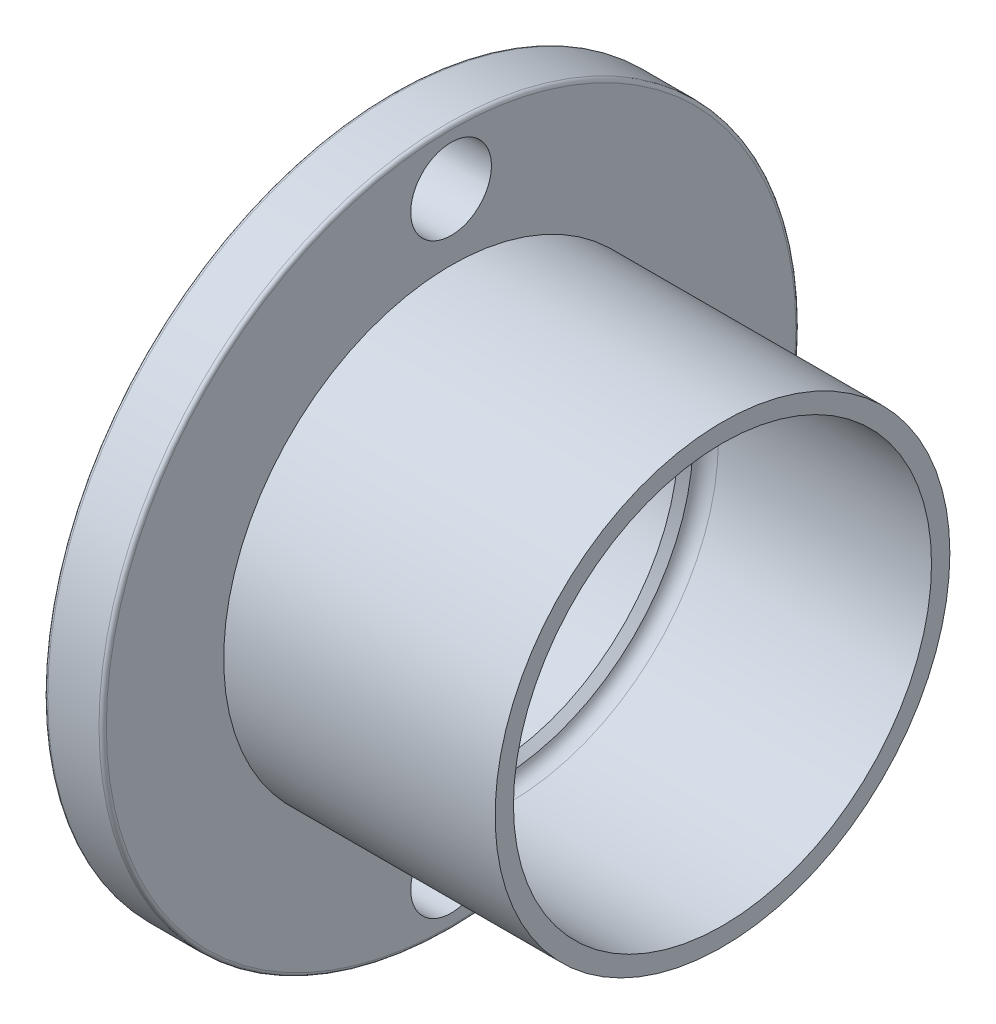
ISO-10303-21;
HEADER;
FILE_DESCRIPTION(('STEP AP214'),'2;1');
FILE_NAME('part.step','',(''),(''),'','','');
FILE_SCHEMA(('AUTOMOTIVE_DESIGN { 1 0 10303 214 1 1 1 1 }'));
ENDSEC;
DATA;
#1=APPLICATION_CONTEXT('core data for automotive mechanical design processes');
#2=APPLICATION_PROTOCOL_DEFINITION('international standard','automotive_design',2000,#1);
#3=PRODUCT_CONTEXT('',#1,'mechanical');
#4=PRODUCT('Part','Part','',(#3));
#5=PRODUCT_RELATED_PRODUCT_CATEGORY('part','',(#4));
#6=PRODUCT_DEFINITION_FORMATION('','',#4);
#7=PRODUCT_DEFINITION_CONTEXT('part definition',#1,'design');
#8=PRODUCT_DEFINITION('design','',#6,#7);
#9=PRODUCT_DEFINITION_SHAPE('','',#8);
#10=(LENGTH_UNIT() NAMED_UNIT(*) SI_UNIT(.MILLI.,.METRE.));
#11=(NAMED_UNIT(*) PLANE_ANGLE_UNIT() SI_UNIT($,.RADIAN.));
#12=(NAMED_UNIT(*) SI_UNIT($,.STERADIAN.) SOLID_ANGLE_UNIT());
#13=UNCERTAINTY_MEASURE_WITH_UNIT(LENGTH_MEASURE(1.E-05),#10,'distance_accuracy_value','');
#14=(GEOMETRIC_REPRESENTATION_CONTEXT(3) GLOBAL_UNCERTAINTY_ASSIGNED_CONTEXT((#13)) GLOBAL_UNIT_ASSIGNED_CONTEXT((#10,
#11,#12)) REPRESENTATION_CONTEXT('',''));
#15=CARTESIAN_POINT('',(0.,0.,0.));
#16=DIRECTION('',(0.,0.,1.));
#17=DIRECTION('',(1.,0.,0.));
#18=AXIS2_PLACEMENT_3D('',#15,#16,#17);
#19=CARTESIAN_POINT('',(4.,0.,0.));
#20=DIRECTION('',(-1.,0.,0.));
#21=DIRECTION('',(0.,0.,1.));
#22=AXIS2_PLACEMENT_3D('',#19,#20,#21);
#23=PLANE('',#22);
#24=CARTESIAN_POINT('',(4.,0.,0.));
#25=DIRECTION('',(-1.,0.,0.));
#26=DIRECTION('',(0.,0.,1.));
#27=AXIS2_PLACEMENT_3D('',#24,#25,#26);
#28=CIRCLE('',#27,15.);
#29=CARTESIAN_POINT('',(4.,0.,15.));
#30=VERTEX_POINT('',#29);
#31=EDGE_CURVE('E86',#30,#30,#28,.F.);
#32=ORIENTED_EDGE('',*,*,#31,.F.);
#33=EDGE_LOOP('',(#32));
#34=FACE_BOUND('',#33,.T.);
#35=CARTESIAN_POINT('',(4.,0.,0.));
#36=DIRECTION('',(1.,0.,0.));
#37=DIRECTION('',(0.,0.,-1.));
#38=AXIS2_PLACEMENT_3D('',#35,#36,#37);
#39=CIRCLE('',#38,26.);
#40=CARTESIAN_POINT('',(4.,0.,-26.));
#41=VERTEX_POINT('',#40);
#42=EDGE_CURVE('E62',#41,#41,#39,.T.);
#43=ORIENTED_EDGE('',*,*,#42,.T.);
#44=EDGE_LOOP('',(#43));
#45=FACE_BOUND('',#44,.T.);
#46=ADVANCED_FACE('F33',(#34,#45),#23,.F.);
#47=CARTESIAN_POINT('',(29.9069920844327,0.,0.));
#48=DIRECTION('',(1.,0.,0.));
#49=DIRECTION('',(0.,0.,-1.));
#50=AXIS2_PLACEMENT_3D('',#47,#48,#49);
#51=CYLINDRICAL_SURFACE('',#50,26.);
#52=CARTESIAN_POINT('',(13.,0.,0.));
#53=DIRECTION('',(-1.,0.,0.));
#54=DIRECTION('',(0.,0.,1.));
#55=AXIS2_PLACEMENT_3D('',#52,#53,#54);
#56=CIRCLE('',#55,26.);
#57=CARTESIAN_POINT('',(13.,0.,26.));
#58=VERTEX_POINT('',#57);
#59=EDGE_CURVE('E44',#58,#58,#56,.F.);
#60=ORIENTED_EDGE('',*,*,#59,.T.);
#61=EDGE_LOOP('',(#60));
#62=FACE_BOUND('',#61,.T.);
#63=ORIENTED_EDGE('',*,*,#42,.F.);
#64=EDGE_LOOP('',(#63));
#65=FACE_BOUND('',#64,.T.);
#66=ADVANCED_FACE('F126',(#62,#65),#51,.F.);
#67=CARTESIAN_POINT('',(29.9069920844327,0.,0.));
#68=DIRECTION('',(1.,0.,0.));
#69=DIRECTION('',(0.,0.,-1.));
#70=AXIS2_PLACEMENT_3D('',#67,#68,#69);
#71=CYLINDRICAL_SURFACE('',#70,28.5);
#72=CARTESIAN_POINT('',(15.9364916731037,0.,0.));
#73=DIRECTION('',(-1.,0.,0.));
#74=DIRECTION('',(0.,0.,1.));
#75=AXIS2_PLACEMENT_3D('',#72,#73,#74);
#76=CIRCLE('',#75,28.5);
#77=CARTESIAN_POINT('',(15.9364916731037,0.,28.5));
#78=VERTEX_POINT('',#77);
#79=EDGE_CURVE('E10',#78,#78,#76,.T.);
#80=ORIENTED_EDGE('',*,*,#79,.T.);
#81=EDGE_LOOP('',(#80));
#82=FACE_BOUND('',#81,.T.);
#83=CARTESIAN_POINT('',(45.,0.,0.));
#84=DIRECTION('',(1.,0.,0.));
#85=DIRECTION('',(0.,0.,-1.));
#86=AXIS2_PLACEMENT_3D('',#83,#84,#85);
#87=CIRCLE('',#86,28.5);
#88=CARTESIAN_POINT('',(45.,0.,-28.5));
#89=VERTEX_POINT('',#88);
#90=EDGE_CURVE('E65',#89,#89,#87,.T.);
#91=ORIENTED_EDGE('',*,*,#90,.T.);
#92=EDGE_LOOP('',(#91));
#93=FACE_BOUND('',#92,.T.);
#94=ADVANCED_FACE('F132',(#82,#93),#71,.F.);
#95=CARTESIAN_POINT('',(45.,0.,0.));
#96=DIRECTION('',(-1.,0.,0.));
#97=DIRECTION('',(0.,0.,1.));
#98=AXIS2_PLACEMENT_3D('',#95,#96,#97);
#99=PLANE('',#98);
#100=ORIENTED_EDGE('',*,*,#90,.F.);
#101=EDGE_LOOP('',(#100));
#102=FACE_BOUND('',#101,.T.);
#103=CARTESIAN_POINT('',(45.,0.,0.));
#104=DIRECTION('',(1.,0.,0.));
#105=DIRECTION('',(0.,0.,-1.));
#106=AXIS2_PLACEMENT_3D('',#103,#104,#105);
#107=CIRCLE('',#106,31.);
#108=CARTESIAN_POINT('',(45.,0.,-31.));
#109=VERTEX_POINT('',#108);
#110=EDGE_CURVE('E68',#109,#109,#107,.T.);
#111=ORIENTED_EDGE('',*,*,#110,.T.);
#112=EDGE_LOOP('',(#111));
#113=FACE_BOUND('',#112,.T.);
#114=ADVANCED_FACE('F174',(#102,#113),#99,.F.);
#115=CARTESIAN_POINT('',(29.9069920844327,0.,0.));
#116=DIRECTION('',(1.,0.,0.));
#117=DIRECTION('',(0.,0.,-1.));
#118=AXIS2_PLACEMENT_3D('',#115,#116,#117);
#119=CYLINDRICAL_SURFACE('',#118,31.);
#120=ORIENTED_EDGE('',*,*,#110,.F.);
#121=EDGE_LOOP('',(#120));
#122=FACE_BOUND('',#121,.T.);
#123=CARTESIAN_POINT('',(8.,0.,0.));
#124=DIRECTION('',(1.,0.,0.));
#125=DIRECTION('',(0.,0.,-1.));
#126=AXIS2_PLACEMENT_3D('',#123,#124,#125);
#127=CIRCLE('',#126,31.);
#128=CARTESIAN_POINT('',(8.,0.,-31.));
#129=VERTEX_POINT('',#128);
#130=EDGE_CURVE('E71',#129,#129,#127,.T.);
#131=ORIENTED_EDGE('',*,*,#130,.T.);
#132=EDGE_LOOP('',(#131));
#133=FACE_BOUND('',#132,.T.);
#134=ADVANCED_FACE('F122',(#122,#133),#119,.T.);
#135=CARTESIAN_POINT('',(8.,0.,0.));
#136=DIRECTION('',(-1.,0.,0.));
#137=DIRECTION('',(0.,0.,1.));
#138=AXIS2_PLACEMENT_3D('',#135,#136,#137);
#139=PLANE('',#138);
#140=CARTESIAN_POINT('',(8.00000000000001,-40.,-2.79318507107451E-13));
#141=DIRECTION('',(-1.,0.,0.));
#142=DIRECTION('',(0.,0.,1.));
#143=AXIS2_PLACEMENT_3D('',#140,#141,#142);
#144=CIRCLE('',#143,5.5);
#145=CARTESIAN_POINT('',(8.00000000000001,-40.,5.49999999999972));
#146=VERTEX_POINT('',#145);
#147=EDGE_CURVE('E80',#146,#146,#144,.F.);
#148=ORIENTED_EDGE('',*,*,#147,.F.);
#149=EDGE_LOOP('',(#148));
#150=FACE_BOUND('',#149,.T.);
#151=CARTESIAN_POINT('',(8.00000000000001,40.,0.));
#152=DIRECTION('',(-1.,0.,0.));
#153=DIRECTION('',(0.,0.,1.));
#154=AXIS2_PLACEMENT_3D('',#151,#152,#153);
#155=CIRCLE('',#154,5.5);
#156=CARTESIAN_POINT('',(8.00000000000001,40.,5.5));
#157=VERTEX_POINT('',#156);
#158=EDGE_CURVE('E74',#157,#157,#155,.F.);
#159=ORIENTED_EDGE('',*,*,#158,.F.);
#160=EDGE_LOOP('',(#159));
#161=FACE_BOUND('',#160,.T.);
#162=CARTESIAN_POINT('',(8.,0.,0.));
#163=DIRECTION('',(-1.,0.,0.));
#164=DIRECTION('',(0.,0.,1.));
#165=AXIS2_PLACEMENT_3D('',#162,#163,#164);
#166=CIRCLE('',#165,47.);
#167=CARTESIAN_POINT('',(8.,0.,47.));
#168=VERTEX_POINT('',#167);
#169=EDGE_CURVE('E59',#168,#168,#166,.F.);
#170=ORIENTED_EDGE('',*,*,#169,.T.);
#171=EDGE_LOOP('',(#170));
#172=FACE_BOUND('',#171,.T.);
#173=ORIENTED_EDGE('',*,*,#130,.F.);
#174=EDGE_LOOP('',(#173));
#175=FACE_BOUND('',#174,.T.);
#176=ADVANCED_FACE('F116',(#150,#161,#172,#175),#139,.F.);
#177=CARTESIAN_POINT('',(29.9069920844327,0.,0.));
#178=DIRECTION('',(1.,0.,0.));
#179=DIRECTION('',(0.,0.,-1.));
#180=AXIS2_PLACEMENT_3D('',#177,#178,#179);
#181=CYLINDRICAL_SURFACE('',#180,47.5);
#182=CARTESIAN_POINT('',(7.5,0.,0.));
#183=DIRECTION('',(-1.,0.,0.));
#184=DIRECTION('',(0.,0.,1.));
#185=AXIS2_PLACEMENT_3D('',#182,#183,#184);
#186=CIRCLE('',#185,47.5);
#187=CARTESIAN_POINT('',(7.5,0.,47.5));
#188=VERTEX_POINT('',#187);
#189=EDGE_CURVE('E53',#188,#188,#186,.T.);
#190=ORIENTED_EDGE('',*,*,#189,.T.);
#191=EDGE_LOOP('',(#190));
#192=FACE_BOUND('',#191,.T.);
#193=CARTESIAN_POINT('',(0.5,0.,0.));
#194=DIRECTION('',(1.,0.,0.));
#195=DIRECTION('',(0.,0.,-1.));
#196=AXIS2_PLACEMENT_3D('',#193,#194,#195);
#197=CIRCLE('',#196,47.5);
#198=CARTESIAN_POINT('',(0.5,0.,-47.5));
#199=VERTEX_POINT('',#198);
#200=EDGE_CURVE('E56',#199,#199,#197,.T.);
#201=ORIENTED_EDGE('',*,*,#200,.T.);
#202=EDGE_LOOP('',(#201));
#203=FACE_BOUND('',#202,.T.);
#204=ADVANCED_FACE('F100',(#192,#203),#181,.T.);
#205=CARTESIAN_POINT('',(0.,0.,0.));
#206=DIRECTION('',(1.,0.,0.));
#207=DIRECTION('',(0.,0.,-1.));
#208=AXIS2_PLACEMENT_3D('',#205,#206,#207);
#209=PLANE('',#208);
#210=CARTESIAN_POINT('',(0.,0.,0.));
#211=DIRECTION('',(-1.,0.,0.));
#212=DIRECTION('',(0.,0.,1.));
#213=AXIS2_PLACEMENT_3D('',#210,#211,#212);
#214=CIRCLE('',#213,15.);
#215=CARTESIAN_POINT('',(0.,0.,15.));
#216=VERTEX_POINT('',#215);
#217=EDGE_CURVE('E89',#216,#216,#214,.T.);
#218=ORIENTED_EDGE('',*,*,#217,.F.);
#219=EDGE_LOOP('',(#218));
#220=FACE_BOUND('',#219,.T.);
#221=CARTESIAN_POINT('',(0.,-40.,-2.79318507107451E-13));
#222=DIRECTION('',(-1.,0.,0.));
#223=DIRECTION('',(0.,0.,-1.));
#224=AXIS2_PLACEMENT_3D('',#221,#222,#223);
#225=CIRCLE('',#224,5.5);
#226=CARTESIAN_POINT('',(0.,-40.,-5.50000000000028));
#227=VERTEX_POINT('',#226);
#228=EDGE_CURVE('E83',#227,#227,#225,.T.);
#229=ORIENTED_EDGE('',*,*,#228,.F.);
#230=EDGE_LOOP('',(#229));
#231=FACE_BOUND('',#230,.T.);
#232=CARTESIAN_POINT('',(0.,40.,0.));
#233=DIRECTION('',(-1.,0.,0.));
#234=DIRECTION('',(0.,0.,1.));
#235=AXIS2_PLACEMENT_3D('',#232,#233,#234);
#236=CIRCLE('',#235,5.5);
#237=CARTESIAN_POINT('',(0.,40.,5.5));
#238=VERTEX_POINT('',#237);
#239=EDGE_CURVE('E77',#238,#238,#236,.T.);
#240=ORIENTED_EDGE('',*,*,#239,.F.);
#241=EDGE_LOOP('',(#240));
#242=FACE_BOUND('',#241,.T.);
#243=CARTESIAN_POINT('',(0.,0.,0.));
#244=DIRECTION('',(1.,0.,0.));
#245=DIRECTION('',(0.,0.,-1.));
#246=AXIS2_PLACEMENT_3D('',#243,#244,#245);
#247=CIRCLE('',#246,47.);
#248=CARTESIAN_POINT('',(0.,0.,-47.));
#249=VERTEX_POINT('',#248);
#250=EDGE_CURVE('E48',#249,#249,#247,.F.);
#251=ORIENTED_EDGE('',*,*,#250,.T.);
#252=EDGE_LOOP('',(#251));
#253=FACE_BOUND('',#252,.T.);
#254=ADVANCED_FACE('F96',(#220,#231,#242,#253),#209,.F.);
#255=CARTESIAN_POINT('',(7.5,0.,0.));
#256=DIRECTION('',(-1.,0.,0.));
#257=DIRECTION('',(0.,0.,1.));
#258=AXIS2_PLACEMENT_3D('',#255,#256,#257);
#259=TOROIDAL_SURFACE('',#258,47.,0.5);
#260=ORIENTED_EDGE('',*,*,#189,.F.);
#261=EDGE_LOOP('',(#260));
#262=FACE_BOUND('',#261,.T.);
#263=ORIENTED_EDGE('',*,*,#169,.F.);
#264=EDGE_LOOP('',(#263));
#265=FACE_BOUND('',#264,.T.);
#266=ADVANCED_FACE('F99',(#262,#265),#259,.T.);
#267=CARTESIAN_POINT('',(0.5,0.,0.));
#268=DIRECTION('',(1.,0.,0.));
#269=DIRECTION('',(0.,0.,-1.));
#270=AXIS2_PLACEMENT_3D('',#267,#268,#269);
#271=TOROIDAL_SURFACE('',#270,47.,0.5);
#272=ORIENTED_EDGE('',*,*,#250,.F.);
#273=EDGE_LOOP('',(#272));
#274=FACE_BOUND('',#273,.T.);
#275=ORIENTED_EDGE('',*,*,#200,.F.);
#276=EDGE_LOOP('',(#275));
#277=FACE_BOUND('',#276,.T.);
#278=ADVANCED_FACE('F108',(#274,#277),#271,.T.);
#279=CARTESIAN_POINT('',(45.001,40.,0.));
#280=DIRECTION('',(-1.,0.,0.));
#281=DIRECTION('',(0.,0.,1.));
#282=AXIS2_PLACEMENT_3D('',#279,#280,#281);
#283=CYLINDRICAL_SURFACE('',#282,5.5);
#284=ORIENTED_EDGE('',*,*,#239,.T.);
#285=EDGE_LOOP('',(#284));
#286=FACE_BOUND('',#285,.T.);
#287=ORIENTED_EDGE('',*,*,#158,.T.);
#288=EDGE_LOOP('',(#287));
#289=FACE_BOUND('',#288,.T.);
#290=ADVANCED_FACE('F111',(#286,#289),#283,.F.);
#291=CARTESIAN_POINT('',(45.001,-40.,-2.79318507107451E-13));
#292=DIRECTION('',(-1.,0.,0.));
#293=DIRECTION('',(0.,0.,1.));
#294=AXIS2_PLACEMENT_3D('',#291,#292,#293);
#295=CYLINDRICAL_SURFACE('',#294,5.5);
#296=ORIENTED_EDGE('',*,*,#228,.T.);
#297=EDGE_LOOP('',(#296));
#298=FACE_BOUND('',#297,.T.);
#299=ORIENTED_EDGE('',*,*,#147,.T.);
#300=EDGE_LOOP('',(#299));
#301=FACE_BOUND('',#300,.T.);
#302=ADVANCED_FACE('F149',(#298,#301),#295,.F.);
#303=CARTESIAN_POINT('',(45.001,0.,0.));
#304=DIRECTION('',(-1.,0.,0.));
#305=DIRECTION('',(0.,0.,1.));
#306=AXIS2_PLACEMENT_3D('',#303,#304,#305);
#307=CYLINDRICAL_SURFACE('',#306,15.);
#308=ORIENTED_EDGE('',*,*,#217,.T.);
#309=EDGE_LOOP('',(#308));
#310=FACE_BOUND('',#309,.T.);
#311=ORIENTED_EDGE('',*,*,#31,.T.);
#312=EDGE_LOOP('',(#311));
#313=FACE_BOUND('',#312,.T.);
#314=ADVANCED_FACE('F93',(#310,#313),#307,.F.);
#315=CARTESIAN_POINT('',(13.,0.,0.));
#316=DIRECTION('',(1.,0.,0.));
#317=DIRECTION('',(0.,0.,-1.));
#318=AXIS2_PLACEMENT_3D('',#315,#316,#317);
#319=CONICAL_SURFACE('',#318,26.,0.785398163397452);
#320=CARTESIAN_POINT('',(14.,0.,0.));
#321=DIRECTION('',(-1.,0.,0.));
#322=DIRECTION('',(0.,0.,1.));
#323=AXIS2_PLACEMENT_3D('',#320,#321,#322);
#324=CIRCLE('',#323,27.);
#325=CARTESIAN_POINT('',(14.,0.,27.));
#326=VERTEX_POINT('',#325);
#327=EDGE_CURVE('E40',#326,#326,#324,.T.);
#328=ORIENTED_EDGE('',*,*,#327,.F.);
#329=EDGE_LOOP('',(#328));
#330=FACE_BOUND('',#329,.T.);
#331=ORIENTED_EDGE('',*,*,#59,.F.);
#332=EDGE_LOOP('',(#331));
#333=FACE_BOUND('',#332,.T.);
#334=ADVANCED_FACE('F141',(#330,#333),#319,.F.);
#335=CARTESIAN_POINT('',(15.9364916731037,0.,0.));
#336=DIRECTION('',(-1.,0.,0.));
#337=DIRECTION('',(0.,0.,1.));
#338=AXIS2_PLACEMENT_3D('',#335,#336,#337);
#339=TOROIDAL_SURFACE('',#338,26.5,2.);
#340=ORIENTED_EDGE('',*,*,#79,.F.);
#341=EDGE_LOOP('',(#340));
#342=FACE_BOUND('',#341,.T.);
#343=ORIENTED_EDGE('',*,*,#327,.T.);
#344=EDGE_LOOP('',(#343));
#345=FACE_BOUND('',#344,.T.);
#346=ADVANCED_FACE('F35',(#342,#345),#339,.F.);
#347=CLOSED_SHELL('',(#46,#66,#94,#114,#134,#176,#204,#254,#266,#278,#290,#302,#314,#334,#346));
#348=MANIFOLD_SOLID_BREP('B2',#347);
#349=ADVANCED_BREP_SHAPE_REPRESENTATION('',(#18,#348),#14);
#350=SHAPE_DEFINITION_REPRESENTATION(#9,#349);
ENDSEC;
END-ISO-10303-21;
